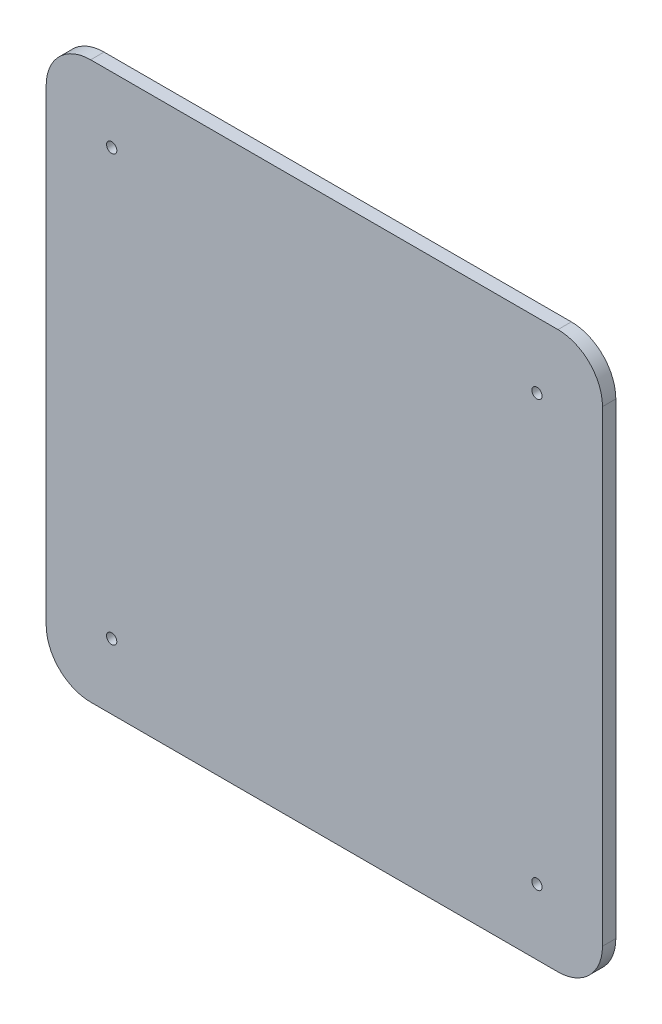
from build123d import *

# Parameters (mm, degrees)
CROQUIS1_W              = 125
CROQUIS1_H              = 125
SALIENTE_EXTRUIR1_DEPTH = 3
REDONDEO1_R             = 10
CROQUIS5_R              = 1.15
CORTAR_EXTRUIR3_DEPTH   = 3


with BuildPart() as part:
    # Croquis1 → Saliente-Extruir1 (new body)
    with BuildSketch(Plane.XY):
        with Locations((62.5, 62.5)):
            Rectangle(CROQUIS1_W, CROQUIS1_H)
    extrude(amount=SALIENTE_EXTRUIR1_DEPTH)

    # Redondeo1
    redondeo1_edges = [part.edges().sort_by_distance(p)[0] for p in [
        (0, 125, 1.5),
        (125, 125, 1.5),
        (125, 0, 1.5),
        (0, 0, 1.5),
    ]]
    fillet(redondeo1_edges, radius=REDONDEO1_R)

    # Croquis5 → Cortar-Extruir3 (cut)
    with BuildSketch(Plane.XY.offset(3)):
        with Locations((14.721067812, 110.278932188)):
            Circle(CROQUIS5_R)
        with Locations((110.278932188, 14.721067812)):
            Circle(CROQUIS5_R)
        with Locations((110.278932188, 110.278932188)):
            Circle(CROQUIS5_R)
        with Locations((14.721067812, 14.721067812)):
            Circle(CROQUIS5_R)
    extrude(amount=-CORTAR_EXTRUIR3_DEPTH, mode=Mode.SUBTRACT)


solid = part.part
